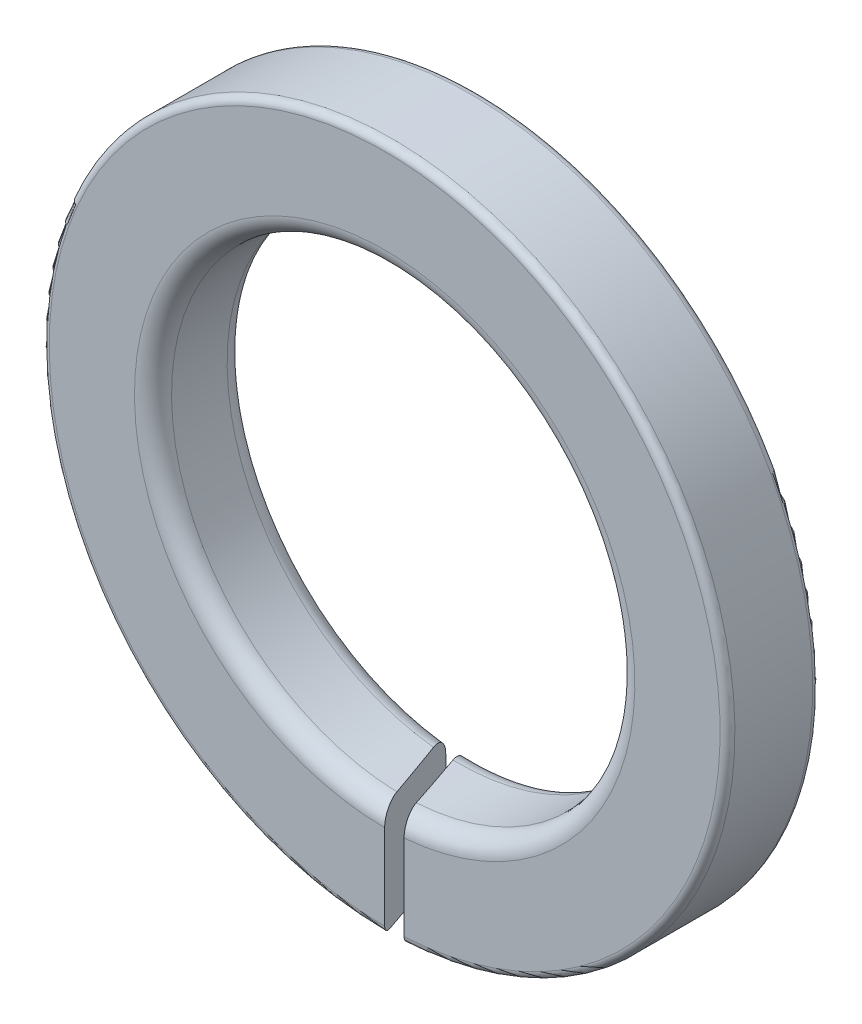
from build123d import *

# Parameters (mm, degrees)
ESQUISSE1_R             = 9.25
ESQUISSE1_R_2           = 6.25
EXTRUSION1_DEPTH        = 2.5
ENL_V_MAT_EXTRU_1_DEPTH = 14.318220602
CONG_1_R                = 0.5
CONG_2_R                = 0.2


with BuildPart() as part:
    # Esquisse1 → Extrusion1 (new body)
    with BuildSketch(Plane.XY):
        Circle(ESQUISSE1_R)
        Circle(ESQUISSE1_R_2, mode=Mode.SUBTRACT)
    extrude(amount=EXTRUSION1_DEPTH)

    # Esquisse2 → Enl_v. mat.-Extru.1 (cut, through all)
    with BuildSketch(Plane(origin=(0, 0, 0), x_dir=(1, 0, 0), z_dir=(0, 1, 0))):
        Polygon((-0.851663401, 0), (0, -2.5), (0.524617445, -2.5), (-0.327045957, 0), align=None)
    extrude(amount=-ENL_V_MAT_EXTRU_1_DEPTH, mode=Mode.SUBTRACT)

    # Cong_1
    cong_1_edges = [part.edges().sort_by_distance(p)[0] for p in [
        (-4.419417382, 4.419417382, 2.5),
        (-4.107286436, 4.710912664, 0),
    ]]
    fillet(cong_1_edges, radius=CONG_1_R)

    # Cong_2
    cong_2_edges = [part.edges().sort_by_distance(p)[0] for p in [
        (-6.540737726, 6.540737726, 2.5),
        (-6.232359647, 6.835217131, 0),
    ]]
    fillet(cong_2_edges, radius=CONG_2_R)


solid = part.part
